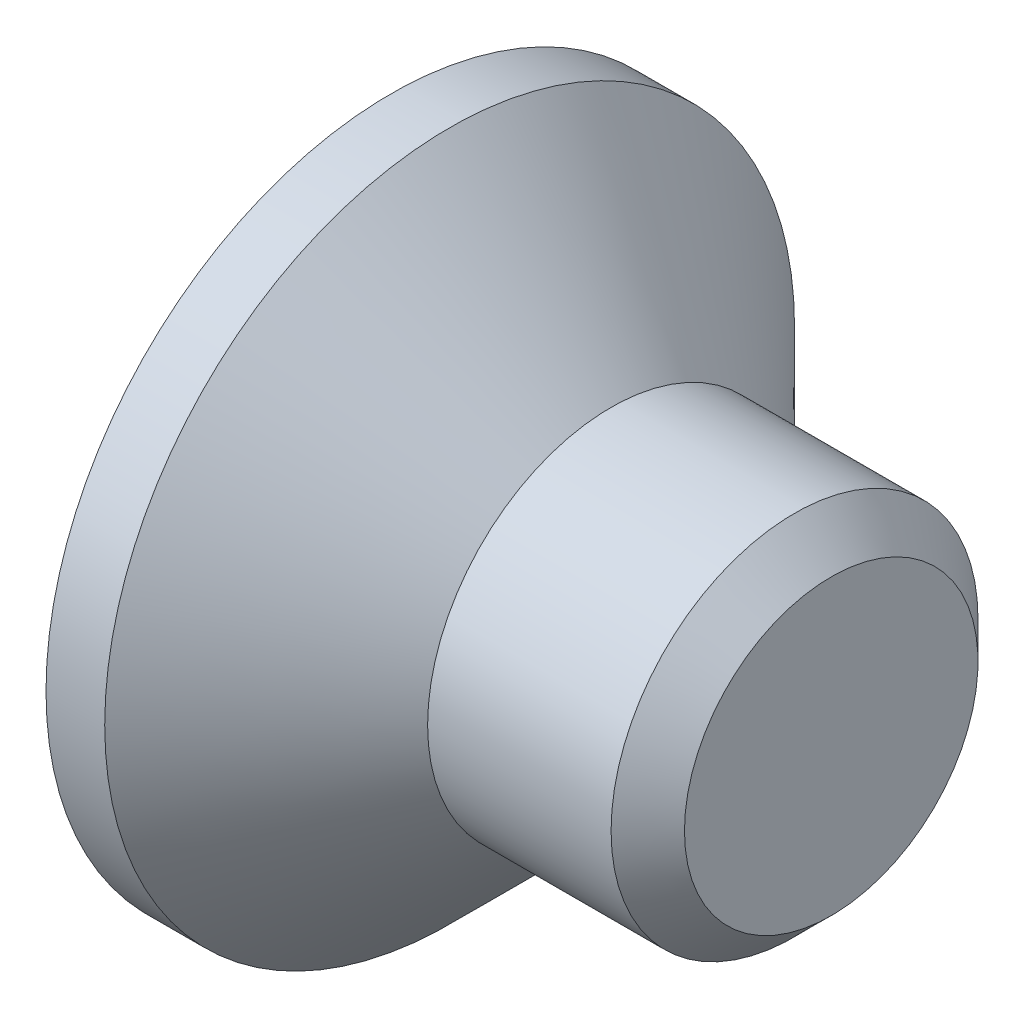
from build123d import *

# Parameters (mm, degrees)
CHAMFER1_SIZE      = 0.25
CUT_EXTRUDE1_DEPTH = 1.25


with BuildPart() as part:
    # Sketch1 → Revolve1 (revolve)
    with BuildSketch(Plane.XY, mode=Mode.PRIVATE) as revolve1_sk:
        Polygon((-1.5, 2.35), (-1.5, 0), (1.5, 0), (1.5, 1.25), (0, 1.25), (-1.1, 2.35), align=None)
    revolve(revolve1_sk.sketch.rotate(Axis((-1.5, 0, 0), (1, 0, 0)), 90), axis=Axis((-1.5, 0, 0), (1, 0, 0)))

    # Chamfer1
    chamfer1_edges = [part.edges().sort_by_distance(p)[0] for p in [
        (1.5, 0, -1.25),
    ]]
    chamfer(chamfer1_edges, length=CHAMFER1_SIZE)

    # Sketch2 → Cut-Extrude1 (cut)
    with BuildSketch(Plane.ZY.offset(1.5)):
        Polygon((-0.34, 1.35), (0.34, 1.35), (0.34, 0.34), (1.35, 0.34), (1.35, -0.34), (0.34, -0.34), (0.34, -1.35), (-0.34, -1.35), (-0.34, -0.34), (-1.35, -0.34), (-1.35, 0.34), (-0.34, 0.34), align=None)
    extrude(amount=-CUT_EXTRUDE1_DEPTH, mode=Mode.SUBTRACT)


solid = part.part
